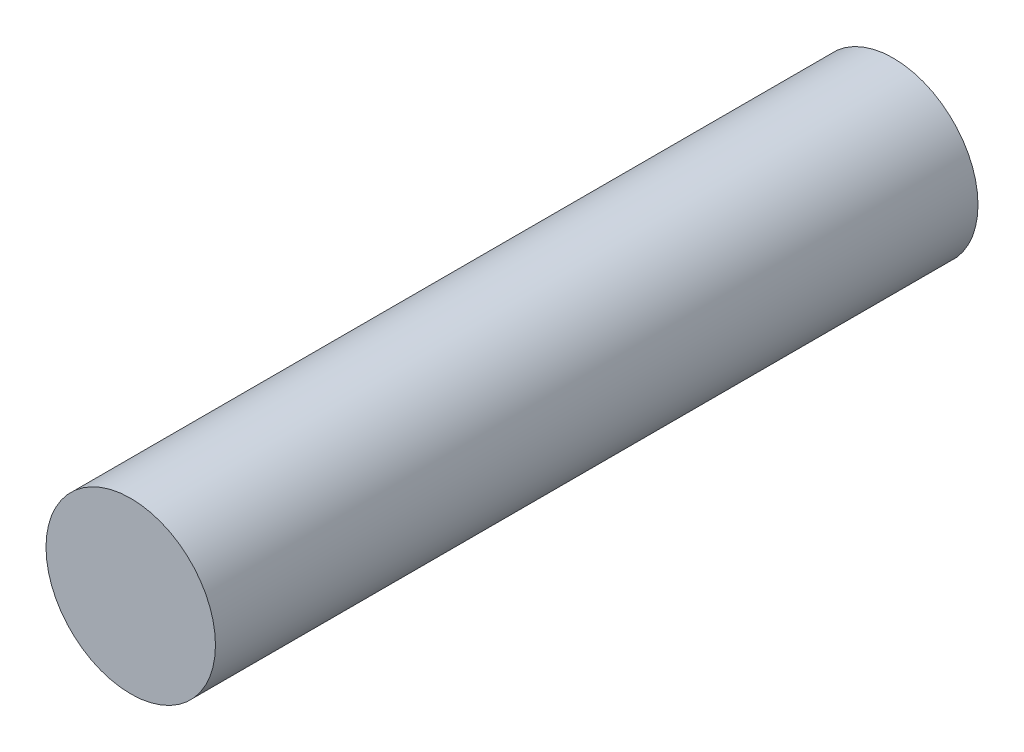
ISO-10303-21;
HEADER;
FILE_DESCRIPTION(('STEP AP214'),'2;1');
FILE_NAME('part.step','',(''),(''),'','','');
FILE_SCHEMA(('AUTOMOTIVE_DESIGN { 1 0 10303 214 1 1 1 1 }'));
ENDSEC;
DATA;
#1=APPLICATION_CONTEXT('core data for automotive mechanical design processes');
#2=APPLICATION_PROTOCOL_DEFINITION('international standard','automotive_design',2000,#1);
#3=PRODUCT_CONTEXT('',#1,'mechanical');
#4=PRODUCT('Part','Part','',(#3));
#5=PRODUCT_RELATED_PRODUCT_CATEGORY('part','',(#4));
#6=PRODUCT_DEFINITION_FORMATION('','',#4);
#7=PRODUCT_DEFINITION_CONTEXT('part definition',#1,'design');
#8=PRODUCT_DEFINITION('design','',#6,#7);
#9=PRODUCT_DEFINITION_SHAPE('','',#8);
#10=(LENGTH_UNIT() NAMED_UNIT(*) SI_UNIT(.MILLI.,.METRE.));
#11=(NAMED_UNIT(*) PLANE_ANGLE_UNIT() SI_UNIT($,.RADIAN.));
#12=(NAMED_UNIT(*) SI_UNIT($,.STERADIAN.) SOLID_ANGLE_UNIT());
#13=UNCERTAINTY_MEASURE_WITH_UNIT(LENGTH_MEASURE(1.E-05),#10,'distance_accuracy_value','');
#14=(GEOMETRIC_REPRESENTATION_CONTEXT(3) GLOBAL_UNCERTAINTY_ASSIGNED_CONTEXT((#13)) GLOBAL_UNIT_ASSIGNED_CONTEXT((#10,
#11,#12)) REPRESENTATION_CONTEXT('',''));
#15=CARTESIAN_POINT('',(0.,0.,0.));
#16=DIRECTION('',(0.,0.,1.));
#17=DIRECTION('',(1.,0.,0.));
#18=AXIS2_PLACEMENT_3D('',#15,#16,#17);
#19=CARTESIAN_POINT('',(0.,0.,180.));
#20=DIRECTION('',(0.,0.,-1.));
#21=DIRECTION('',(-1.,0.,0.));
#22=AXIS2_PLACEMENT_3D('',#19,#20,#21);
#23=CYLINDRICAL_SURFACE('',#22,20.);
#24=CARTESIAN_POINT('',(0.,0.,180.));
#25=DIRECTION('',(0.,0.,1.));
#26=DIRECTION('',(1.,0.,0.));
#27=AXIS2_PLACEMENT_3D('',#24,#25,#26);
#28=CIRCLE('',#27,20.);
#29=CARTESIAN_POINT('',(-20.,0.,180.));
#30=VERTEX_POINT('',#29);
#31=EDGE_CURVE('E10',#30,#30,#28,.T.);
#32=CARTESIAN_POINT('',(0.,0.,0.));
#33=DIRECTION('',(0.,0.,1.));
#34=DIRECTION('',(1.,0.,0.));
#35=AXIS2_PLACEMENT_3D('',#32,#33,#34);
#36=CIRCLE('',#35,20.);
#37=CARTESIAN_POINT('',(-20.,0.,0.));
#38=VERTEX_POINT('',#37);
#39=EDGE_CURVE('E35',#38,#38,#36,.T.);
#40=CARTESIAN_POINT('',(-20.,0.,180.));
#41=CARTESIAN_POINT('',(-20.,0.,178.125));
#42=CARTESIAN_POINT('',(-20.,0.,176.25));
#43=CARTESIAN_POINT('',(-20.,0.,172.5));
#44=CARTESIAN_POINT('',(-20.,0.,170.625));
#45=CARTESIAN_POINT('',(-20.,0.,166.875));
#46=CARTESIAN_POINT('',(-20.,0.,165.));
#47=CARTESIAN_POINT('',(-20.,0.,161.25));
#48=CARTESIAN_POINT('',(-20.,0.,159.375));
#49=CARTESIAN_POINT('',(-20.,0.,155.625));
#50=CARTESIAN_POINT('',(-20.,0.,153.75));
#51=CARTESIAN_POINT('',(-20.,0.,150.));
#52=CARTESIAN_POINT('',(-20.,0.,148.125));
#53=CARTESIAN_POINT('',(-20.,0.,144.375));
#54=CARTESIAN_POINT('',(-20.,0.,142.5));
#55=CARTESIAN_POINT('',(-20.,0.,138.75));
#56=CARTESIAN_POINT('',(-20.,0.,136.875));
#57=CARTESIAN_POINT('',(-20.,0.,133.125));
#58=CARTESIAN_POINT('',(-20.,0.,131.25));
#59=CARTESIAN_POINT('',(-20.,0.,127.5));
#60=CARTESIAN_POINT('',(-20.,0.,125.625));
#61=CARTESIAN_POINT('',(-20.,0.,121.875));
#62=CARTESIAN_POINT('',(-20.,0.,120.));
#63=CARTESIAN_POINT('',(-20.,0.,116.25));
#64=CARTESIAN_POINT('',(-20.,0.,114.375));
#65=CARTESIAN_POINT('',(-20.,0.,110.625));
#66=CARTESIAN_POINT('',(-20.,0.,108.75));
#67=CARTESIAN_POINT('',(-20.,0.,105.));
#68=CARTESIAN_POINT('',(-20.,0.,103.125));
#69=CARTESIAN_POINT('',(-20.,0.,99.375));
#70=CARTESIAN_POINT('',(-20.,0.,97.5));
#71=CARTESIAN_POINT('',(-20.,0.,93.75));
#72=CARTESIAN_POINT('',(-20.,0.,91.875));
#73=CARTESIAN_POINT('',(-20.,0.,88.125));
#74=CARTESIAN_POINT('',(-20.,0.,86.25));
#75=CARTESIAN_POINT('',(-20.,0.,82.5));
#76=CARTESIAN_POINT('',(-20.,0.,80.625));
#77=CARTESIAN_POINT('',(-20.,0.,76.875));
#78=CARTESIAN_POINT('',(-20.,0.,75.));
#79=CARTESIAN_POINT('',(-20.,0.,71.25));
#80=CARTESIAN_POINT('',(-20.,0.,69.375));
#81=CARTESIAN_POINT('',(-20.,0.,65.625));
#82=CARTESIAN_POINT('',(-20.,0.,63.75));
#83=CARTESIAN_POINT('',(-20.,0.,60.));
#84=CARTESIAN_POINT('',(-20.,0.,58.125));
#85=CARTESIAN_POINT('',(-20.,0.,54.375));
#86=CARTESIAN_POINT('',(-20.,0.,52.5));
#87=CARTESIAN_POINT('',(-20.,0.,48.75));
#88=CARTESIAN_POINT('',(-20.,0.,46.875));
#89=CARTESIAN_POINT('',(-20.,0.,43.125));
#90=CARTESIAN_POINT('',(-20.,0.,41.25));
#91=CARTESIAN_POINT('',(-20.,0.,37.5));
#92=CARTESIAN_POINT('',(-20.,0.,35.625));
#93=CARTESIAN_POINT('',(-20.,0.,31.875));
#94=CARTESIAN_POINT('',(-20.,0.,30.));
#95=CARTESIAN_POINT('',(-20.,0.,26.25));
#96=CARTESIAN_POINT('',(-20.,0.,24.375));
#97=CARTESIAN_POINT('',(-20.,0.,20.625));
#98=CARTESIAN_POINT('',(-20.,0.,18.75));
#99=CARTESIAN_POINT('',(-20.,0.,15.));
#100=CARTESIAN_POINT('',(-20.,0.,13.125));
#101=CARTESIAN_POINT('',(-20.,0.,9.37499999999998));
#102=CARTESIAN_POINT('',(-20.,0.,7.49999999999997));
#103=CARTESIAN_POINT('',(-20.,0.,3.74999999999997));
#104=CARTESIAN_POINT('',(-20.,0.,1.87499999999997));
#105=CARTESIAN_POINT('',(-20.,0.,0.));
#106=B_SPLINE_CURVE_WITH_KNOTS('',3,(#40,#41,#42,#43,#44,#45,#46,#47,#48,#49,#50,#51,#52,#53,
#54,#55,#56,#57,#58,#59,#60,#61,#62,#63,#64,#65,#66,#67,#68,#69,#70,#71,#72,#73,#74,#75,#76,#77,
#78,#79,#80,#81,#82,#83,#84,#85,#86,#87,#88,#89,#90,#91,#92,#93,#94,#95,#96,#97,#98,#99,#100,
#101,#102,#103,#104,#105),.UNSPECIFIED.,.F.,.F.,(4,2,2,2,2,2,2,2,2,2,2,2,2,2,2,2,2,2,2,2,2,2,2,
2,2,2,2,2,2,2,2,2,4),(0.,5.62500000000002,11.25,16.875,22.5,28.125,33.75,39.375,45.,50.625,
56.25,61.875,67.5,73.125,78.75,84.375,90.,95.625,101.25,106.875,112.5,118.125,123.75,129.375,
135.,140.625,146.25,151.875,157.5,163.125,168.75,174.375,180.),.UNSPECIFIED.);
#107=EDGE_CURVE('BSEAM29',#30,#38,#106,.T.);
#108=ORIENTED_EDGE('',*,*,#31,.F.);
#109=ORIENTED_EDGE('',*,*,#39,.T.);
#110=ORIENTED_EDGE('',*,*,#107,.T.);
#111=ORIENTED_EDGE('',*,*,#107,.F.);
#112=EDGE_LOOP('',(#108,#110,#109,#111));
#113=FACE_BOUND('',#112,.T.);
#114=ADVANCED_FACE('F29',(#113),#23,.T.);
#115=CARTESIAN_POINT('',(0.,0.,180.));
#116=DIRECTION('',(0.,0.,1.));
#117=DIRECTION('',(1.,0.,0.));
#118=AXIS2_PLACEMENT_3D('',#115,#116,#117);
#119=PLANE('',#118);
#120=ORIENTED_EDGE('',*,*,#31,.T.);
#121=EDGE_LOOP('',(#120));
#122=FACE_BOUND('',#121,.T.);
#123=ADVANCED_FACE('F44',(#122),#119,.T.);
#124=CARTESIAN_POINT('',(0.,0.,0.));
#125=DIRECTION('',(0.,0.,1.));
#126=DIRECTION('',(1.,0.,0.));
#127=AXIS2_PLACEMENT_3D('',#124,#125,#126);
#128=PLANE('',#127);
#129=ORIENTED_EDGE('',*,*,#39,.F.);
#130=EDGE_LOOP('',(#129));
#131=FACE_BOUND('',#130,.T.);
#132=ADVANCED_FACE('F42',(#131),#128,.F.);
#133=CLOSED_SHELL('',(#114,#123,#132));
#134=MANIFOLD_SOLID_BREP('B2',#133);
#135=ADVANCED_BREP_SHAPE_REPRESENTATION('',(#18,#134),#14);
#136=SHAPE_DEFINITION_REPRESENTATION(#9,#135);
ENDSEC;
END-ISO-10303-21;
